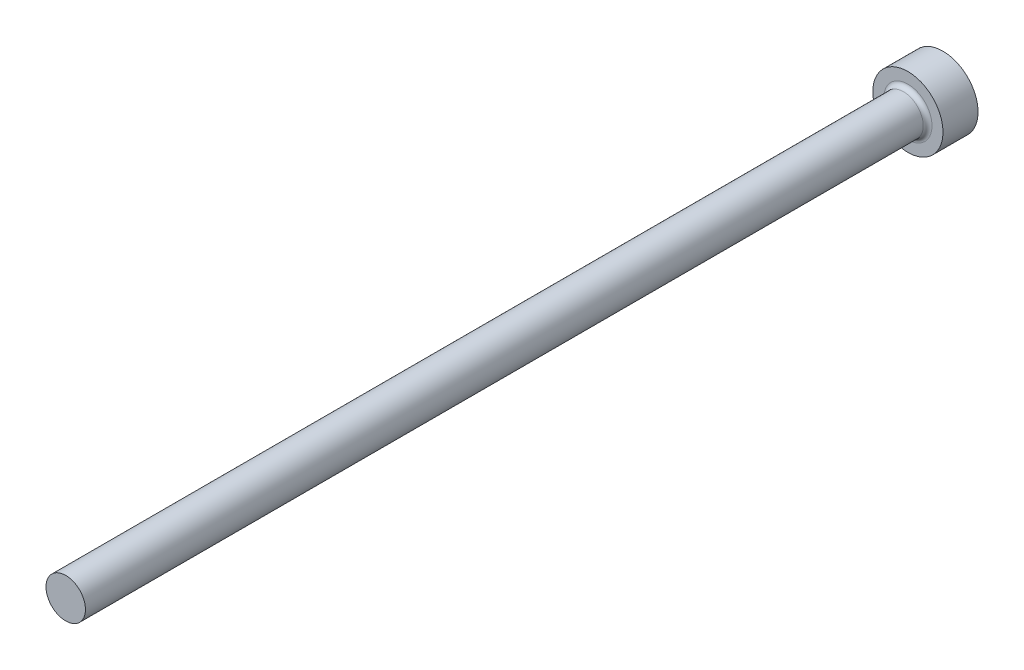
ISO-10303-21;
HEADER;
FILE_DESCRIPTION(('STEP AP214'),'2;1');
FILE_NAME('part.step','',(''),(''),'','','');
FILE_SCHEMA(('AUTOMOTIVE_DESIGN { 1 0 10303 214 1 1 1 1 }'));
ENDSEC;
DATA;
#1=APPLICATION_CONTEXT('core data for automotive mechanical design processes');
#2=APPLICATION_PROTOCOL_DEFINITION('international standard','automotive_design',2000,#1);
#3=PRODUCT_CONTEXT('',#1,'mechanical');
#4=PRODUCT('Part','Part','',(#3));
#5=PRODUCT_RELATED_PRODUCT_CATEGORY('part','',(#4));
#6=PRODUCT_DEFINITION_FORMATION('','',#4);
#7=PRODUCT_DEFINITION_CONTEXT('part definition',#1,'design');
#8=PRODUCT_DEFINITION('design','',#6,#7);
#9=PRODUCT_DEFINITION_SHAPE('','',#8);
#10=(LENGTH_UNIT() NAMED_UNIT(*) SI_UNIT(.MILLI.,.METRE.));
#11=(NAMED_UNIT(*) PLANE_ANGLE_UNIT() SI_UNIT($,.RADIAN.));
#12=(NAMED_UNIT(*) SI_UNIT($,.STERADIAN.) SOLID_ANGLE_UNIT());
#13=UNCERTAINTY_MEASURE_WITH_UNIT(LENGTH_MEASURE(1.E-05),#10,'distance_accuracy_value','');
#14=(GEOMETRIC_REPRESENTATION_CONTEXT(3) GLOBAL_UNCERTAINTY_ASSIGNED_CONTEXT((#13)) GLOBAL_UNIT_ASSIGNED_CONTEXT((#10,
#11,#12)) REPRESENTATION_CONTEXT('',''));
#15=CARTESIAN_POINT('',(0.,0.,0.));
#16=DIRECTION('',(0.,0.,1.));
#17=DIRECTION('',(1.,0.,0.));
#18=AXIS2_PLACEMENT_3D('',#15,#16,#17);
#19=CARTESIAN_POINT('',(4.,0.,4.));
#20=DIRECTION('',(0.,0.,-1.));
#21=DIRECTION('',(-1.,0.,0.));
#22=AXIS2_PLACEMENT_3D('',#19,#20,#21);
#23=PLANE('',#22);
#24=CARTESIAN_POINT('',(0.,0.,4.));
#25=DIRECTION('',(0.,0.,-1.));
#26=DIRECTION('',(-1.,0.,0.));
#27=AXIS2_PLACEMENT_3D('',#24,#25,#26);
#28=CIRCLE('',#27,2.75000000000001);
#29=CARTESIAN_POINT('',(-2.75000000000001,0.,4.));
#30=VERTEX_POINT('',#29);
#31=EDGE_CURVE('E40',#30,#30,#28,.T.);
#32=ORIENTED_EDGE('',*,*,#31,.T.);
#33=EDGE_LOOP('',(#32));
#34=FACE_BOUND('',#33,.T.);
#35=CARTESIAN_POINT('',(0.,0.,4.));
#36=DIRECTION('',(0.,0.,-1.));
#37=DIRECTION('',(-1.,0.,0.));
#38=AXIS2_PLACEMENT_3D('',#35,#36,#37);
#39=CIRCLE('',#38,4.);
#40=CARTESIAN_POINT('',(-4.,0.,4.));
#41=VERTEX_POINT('',#40);
#42=EDGE_CURVE('E44',#41,#41,#39,.T.);
#43=ORIENTED_EDGE('',*,*,#42,.F.);
#44=EDGE_LOOP('',(#43));
#45=FACE_BOUND('',#44,.T.);
#46=ADVANCED_FACE('F33',(#34,#45),#23,.F.);
#47=CARTESIAN_POINT('',(0.,0.,-9.03322817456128));
#48=DIRECTION('',(0.,0.,-1.));
#49=DIRECTION('',(-1.,0.,0.));
#50=AXIS2_PLACEMENT_3D('',#47,#48,#49);
#51=CYLINDRICAL_SURFACE('',#50,4.);
#52=CARTESIAN_POINT('',(0.,0.,0.));
#53=DIRECTION('',(0.,0.,-1.));
#54=DIRECTION('',(-1.,0.,0.));
#55=AXIS2_PLACEMENT_3D('',#52,#53,#54);
#56=CIRCLE('',#55,4.);
#57=CARTESIAN_POINT('',(-4.,0.,0.));
#58=VERTEX_POINT('',#57);
#59=EDGE_CURVE('E48',#58,#58,#56,.T.);
#60=ORIENTED_EDGE('',*,*,#59,.F.);
#61=EDGE_LOOP('',(#60));
#62=FACE_BOUND('',#61,.T.);
#63=ORIENTED_EDGE('',*,*,#42,.T.);
#64=EDGE_LOOP('',(#63));
#65=FACE_BOUND('',#64,.T.);
#66=ADVANCED_FACE('F68',(#62,#65),#51,.T.);
#67=CARTESIAN_POINT('',(0.,0.,0.));
#68=DIRECTION('',(0.,0.,1.));
#69=DIRECTION('',(1.,0.,0.));
#70=AXIS2_PLACEMENT_3D('',#67,#68,#69);
#71=PLANE('',#70);
#72=ORIENTED_EDGE('',*,*,#59,.T.);
#73=EDGE_LOOP('',(#72));
#74=FACE_BOUND('',#73,.T.);
#75=ADVANCED_FACE('F61',(#74),#71,.F.);
#76=CARTESIAN_POINT('',(0.,0.,100.));
#77=DIRECTION('',(0.,0.,-1.));
#78=DIRECTION('',(-1.,0.,0.));
#79=AXIS2_PLACEMENT_3D('',#76,#77,#78);
#80=PLANE('',#79);
#81=CARTESIAN_POINT('',(0.,0.,100.));
#82=DIRECTION('',(0.,0.,-1.));
#83=DIRECTION('',(-1.,0.,0.));
#84=AXIS2_PLACEMENT_3D('',#81,#82,#83);
#85=CIRCLE('',#84,2.25000000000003);
#86=CARTESIAN_POINT('',(-2.25000000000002,0.,100.));
#87=VERTEX_POINT('',#86);
#88=EDGE_CURVE('E53',#87,#87,#85,.T.);
#89=ORIENTED_EDGE('',*,*,#88,.F.);
#90=EDGE_LOOP('',(#89));
#91=FACE_BOUND('',#90,.T.);
#92=ADVANCED_FACE('F59',(#91),#80,.F.);
#93=CARTESIAN_POINT('',(0.,0.,-9.03322817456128));
#94=DIRECTION('',(0.,0.,-1.));
#95=DIRECTION('',(-1.,0.,0.));
#96=AXIS2_PLACEMENT_3D('',#93,#94,#95);
#97=CYLINDRICAL_SURFACE('',#96,2.25000000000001);
#98=CARTESIAN_POINT('',(0.,0.,4.5));
#99=DIRECTION('',(0.,0.,-1.));
#100=DIRECTION('',(-1.,0.,0.));
#101=AXIS2_PLACEMENT_3D('',#98,#99,#100);
#102=CIRCLE('',#101,2.25000000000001);
#103=CARTESIAN_POINT('',(-2.25000000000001,0.,4.5));
#104=VERTEX_POINT('',#103);
#105=EDGE_CURVE('E10',#104,#104,#102,.F.);
#106=ORIENTED_EDGE('',*,*,#105,.T.);
#107=EDGE_LOOP('',(#106));
#108=FACE_BOUND('',#107,.T.);
#109=ORIENTED_EDGE('',*,*,#88,.T.);
#110=EDGE_LOOP('',(#109));
#111=FACE_BOUND('',#110,.T.);
#112=ADVANCED_FACE('F57',(#108,#111),#97,.T.);
#113=CARTESIAN_POINT('',(0.,0.,4.5));
#114=DIRECTION('',(0.,0.,-1.));
#115=DIRECTION('',(-1.,0.,0.));
#116=AXIS2_PLACEMENT_3D('',#113,#114,#115);
#117=TOROIDAL_SURFACE('',#116,2.75000000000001,0.5);
#118=ORIENTED_EDGE('',*,*,#105,.F.);
#119=EDGE_LOOP('',(#118));
#120=FACE_BOUND('',#119,.T.);
#121=ORIENTED_EDGE('',*,*,#31,.F.);
#122=EDGE_LOOP('',(#121));
#123=FACE_BOUND('',#122,.T.);
#124=ADVANCED_FACE('F35',(#120,#123),#117,.F.);
#125=CLOSED_SHELL('',(#46,#66,#75,#92,#112,#124));
#126=MANIFOLD_SOLID_BREP('B2',#125);
#127=ADVANCED_BREP_SHAPE_REPRESENTATION('',(#18,#126),#14);
#128=SHAPE_DEFINITION_REPRESENTATION(#9,#127);
ENDSEC;
END-ISO-10303-21;
